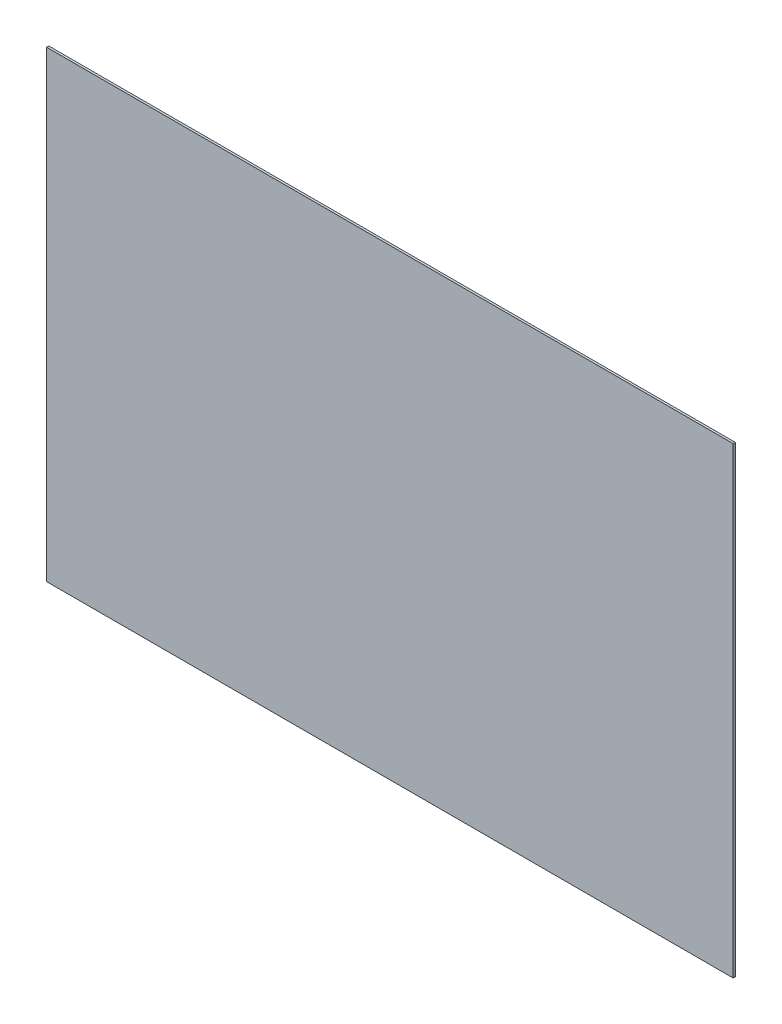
from build123d import *

# Parameters (mm, degrees)
CROQUIS1_W              = 947
CROQUIS1_H              = 638.5
SALIENTE_EXTRUIR1_DEPTH = 3


with BuildPart() as part:
    # Croquis1 → Saliente-Extruir1 (new body)
    with BuildSketch(Plane.XY):
        with Locations((473.5, 319.25)):
            Rectangle(CROQUIS1_W, CROQUIS1_H)
    extrude(amount=SALIENTE_EXTRUIR1_DEPTH)


solid = part.part
